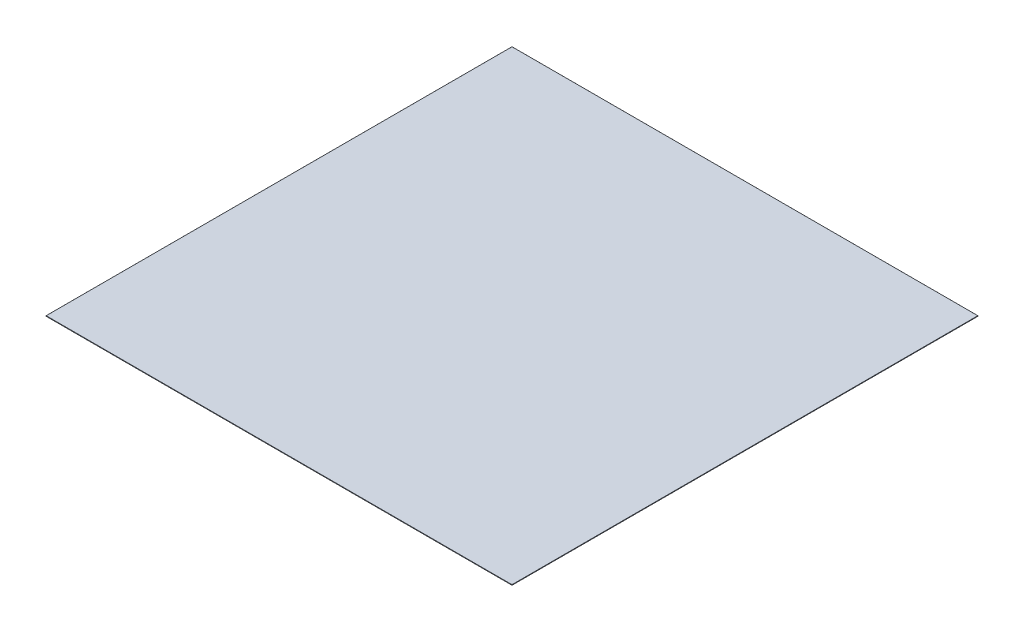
ISO-10303-21;
HEADER;
FILE_DESCRIPTION(('STEP AP214'),'2;1');
FILE_NAME('part.step','',(''),(''),'','','');
FILE_SCHEMA(('AUTOMOTIVE_DESIGN { 1 0 10303 214 1 1 1 1 }'));
ENDSEC;
DATA;
#1=APPLICATION_CONTEXT('core data for automotive mechanical design processes');
#2=APPLICATION_PROTOCOL_DEFINITION('international standard','automotive_design',2000,#1);
#3=PRODUCT_CONTEXT('',#1,'mechanical');
#4=PRODUCT('Part','Part','',(#3));
#5=PRODUCT_RELATED_PRODUCT_CATEGORY('part','',(#4));
#6=PRODUCT_DEFINITION_FORMATION('','',#4);
#7=PRODUCT_DEFINITION_CONTEXT('part definition',#1,'design');
#8=PRODUCT_DEFINITION('design','',#6,#7);
#9=PRODUCT_DEFINITION_SHAPE('','',#8);
#10=(LENGTH_UNIT() NAMED_UNIT(*) SI_UNIT(.MILLI.,.METRE.));
#11=(NAMED_UNIT(*) PLANE_ANGLE_UNIT() SI_UNIT($,.RADIAN.));
#12=(NAMED_UNIT(*) SI_UNIT($,.STERADIAN.) SOLID_ANGLE_UNIT());
#13=UNCERTAINTY_MEASURE_WITH_UNIT(LENGTH_MEASURE(1.E-05),#10,'distance_accuracy_value','');
#14=(GEOMETRIC_REPRESENTATION_CONTEXT(3) GLOBAL_UNCERTAINTY_ASSIGNED_CONTEXT((#13)) GLOBAL_UNIT_ASSIGNED_CONTEXT((#10,
#11,#12)) REPRESENTATION_CONTEXT('',''));
#15=CARTESIAN_POINT('',(0.,0.,0.));
#16=DIRECTION('',(0.,0.,1.));
#17=DIRECTION('',(1.,0.,0.));
#18=AXIS2_PLACEMENT_3D('',#15,#16,#17);
#19=CARTESIAN_POINT('',(-45.,0.05,45.));
#20=DIRECTION('',(1.,0.,0.));
#21=DIRECTION('',(0.,0.,-1.));
#22=AXIS2_PLACEMENT_3D('',#19,#20,#21);
#23=PLANE('',#22);
#24=DIRECTION('',(0.,-1.,0.));
#25=VECTOR('',#24,1.);
#26=CARTESIAN_POINT('',(-45.,0.05,-45.));
#27=LINE('',#26,#25);
#28=CARTESIAN_POINT('',(-45.,0.03,-45.));
#29=VERTEX_POINT('',#28);
#30=CARTESIAN_POINT('',(-45.,-0.03,-45.));
#31=VERTEX_POINT('',#30);
#32=EDGE_CURVE('E142',#29,#31,#27,.T.);
#33=ORIENTED_EDGE('',*,*,#32,.T.);
#34=DIRECTION('',(0.,0.,1.));
#35=VECTOR('',#34,1.);
#36=CARTESIAN_POINT('',(-45.,-0.03,45.));
#37=LINE('',#36,#35);
#38=CARTESIAN_POINT('',(-45.,-0.03,45.));
#39=VERTEX_POINT('',#38);
#40=EDGE_CURVE('E151',#31,#39,#37,.T.);
#41=ORIENTED_EDGE('',*,*,#40,.T.);
#42=DIRECTION('',(0.,-1.,0.));
#43=VECTOR('',#42,1.);
#44=CARTESIAN_POINT('',(-45.,0.05,45.));
#45=LINE('',#44,#43);
#46=CARTESIAN_POINT('',(-45.,0.03,45.));
#47=VERTEX_POINT('',#46);
#48=EDGE_CURVE('E120',#47,#39,#45,.T.);
#49=ORIENTED_EDGE('',*,*,#48,.F.);
#50=DIRECTION('',(0.,0.,1.));
#51=VECTOR('',#50,1.);
#52=CARTESIAN_POINT('',(-45.,0.03,45.));
#53=LINE('',#52,#51);
#54=EDGE_CURVE('E153',#47,#29,#53,.F.);
#55=ORIENTED_EDGE('',*,*,#54,.T.);
#56=EDGE_LOOP('',(#33,#41,#49,#55));
#57=FACE_BOUND('',#56,.T.);
#58=ADVANCED_FACE('F33',(#57),#23,.F.);
#59=CARTESIAN_POINT('',(-45.,0.05,45.));
#60=DIRECTION('',(0.,0.,-1.));
#61=DIRECTION('',(-1.,0.,0.));
#62=AXIS2_PLACEMENT_3D('',#59,#60,#61);
#63=PLANE('',#62);
#64=ORIENTED_EDGE('',*,*,#48,.T.);
#65=DIRECTION('',(1.,0.,0.));
#66=VECTOR('',#65,1.);
#67=CARTESIAN_POINT('',(45.,-0.03,45.));
#68=LINE('',#67,#66);
#69=CARTESIAN_POINT('',(45.,-0.03,45.));
#70=VERTEX_POINT('',#69);
#71=EDGE_CURVE('E119',#39,#70,#68,.T.);
#72=ORIENTED_EDGE('',*,*,#71,.T.);
#73=DIRECTION('',(0.,-1.,0.));
#74=VECTOR('',#73,1.);
#75=CARTESIAN_POINT('',(45.,0.05,45.));
#76=LINE('',#75,#74);
#77=CARTESIAN_POINT('',(45.,0.03,45.));
#78=VERTEX_POINT('',#77);
#79=EDGE_CURVE('E102',#78,#70,#76,.T.);
#80=ORIENTED_EDGE('',*,*,#79,.F.);
#81=DIRECTION('',(1.,0.,0.));
#82=VECTOR('',#81,1.);
#83=CARTESIAN_POINT('',(-45.,0.03,45.));
#84=LINE('',#83,#82);
#85=EDGE_CURVE('E116',#78,#47,#84,.F.);
#86=ORIENTED_EDGE('',*,*,#85,.T.);
#87=EDGE_LOOP('',(#64,#72,#80,#86));
#88=FACE_BOUND('',#87,.T.);
#89=ADVANCED_FACE('F115',(#88),#63,.F.);
#90=CARTESIAN_POINT('',(45.,0.05,45.));
#91=DIRECTION('',(-1.,0.,0.));
#92=DIRECTION('',(0.,0.,1.));
#93=AXIS2_PLACEMENT_3D('',#90,#91,#92);
#94=PLANE('',#93);
#95=ORIENTED_EDGE('',*,*,#79,.T.);
#96=DIRECTION('',(0.,0.,-1.));
#97=VECTOR('',#96,1.);
#98=CARTESIAN_POINT('',(45.,-0.03,-45.));
#99=LINE('',#98,#97);
#100=CARTESIAN_POINT('',(45.,-0.03,-45.));
#101=VERTEX_POINT('',#100);
#102=EDGE_CURVE('E108',#70,#101,#99,.T.);
#103=ORIENTED_EDGE('',*,*,#102,.T.);
#104=DIRECTION('',(0.,-1.,0.));
#105=VECTOR('',#104,1.);
#106=CARTESIAN_POINT('',(45.,0.05,-45.));
#107=LINE('',#106,#105);
#108=CARTESIAN_POINT('',(45.,0.03,-45.));
#109=VERTEX_POINT('',#108);
#110=EDGE_CURVE('E104',#109,#101,#107,.T.);
#111=ORIENTED_EDGE('',*,*,#110,.F.);
#112=DIRECTION('',(0.,0.,-1.));
#113=VECTOR('',#112,1.);
#114=CARTESIAN_POINT('',(45.,0.03,45.));
#115=LINE('',#114,#113);
#116=EDGE_CURVE('E99',#109,#78,#115,.F.);
#117=ORIENTED_EDGE('',*,*,#116,.T.);
#118=EDGE_LOOP('',(#95,#103,#111,#117));
#119=FACE_BOUND('',#118,.T.);
#120=ADVANCED_FACE('F101',(#119),#94,.F.);
#121=CARTESIAN_POINT('',(-45.,0.05,-45.));
#122=DIRECTION('',(0.,0.,1.));
#123=DIRECTION('',(1.,0.,0.));
#124=AXIS2_PLACEMENT_3D('',#121,#122,#123);
#125=PLANE('',#124);
#126=ORIENTED_EDGE('',*,*,#110,.T.);
#127=DIRECTION('',(-1.,0.,0.));
#128=VECTOR('',#127,1.);
#129=CARTESIAN_POINT('',(-45.,-0.03,-45.));
#130=LINE('',#129,#128);
#131=EDGE_CURVE('E155',#101,#31,#130,.T.);
#132=ORIENTED_EDGE('',*,*,#131,.T.);
#133=ORIENTED_EDGE('',*,*,#32,.F.);
#134=DIRECTION('',(-1.,0.,0.));
#135=VECTOR('',#134,1.);
#136=CARTESIAN_POINT('',(-45.,0.03,-45.));
#137=LINE('',#136,#135);
#138=EDGE_CURVE('E157',#29,#109,#137,.F.);
#139=ORIENTED_EDGE('',*,*,#138,.T.);
#140=EDGE_LOOP('',(#126,#132,#133,#139));
#141=FACE_BOUND('',#140,.T.);
#142=ADVANCED_FACE('F195',(#141),#125,.F.);
#143=CARTESIAN_POINT('',(-45.,0.05,-45.));
#144=DIRECTION('',(0.,-1.,0.));
#145=DIRECTION('',(0.,0.,-1.));
#146=AXIS2_PLACEMENT_3D('',#143,#144,#145);
#147=PLANE('',#146);
#148=DIRECTION('',(0.,0.,-1.));
#149=VECTOR('',#148,1.);
#150=CARTESIAN_POINT('',(44.98,0.05,-45.));
#151=LINE('',#150,#149);
#152=CARTESIAN_POINT('',(44.98,0.05,44.98));
#153=VERTEX_POINT('',#152);
#154=CARTESIAN_POINT('',(44.98,0.05,-44.98));
#155=VERTEX_POINT('',#154);
#156=EDGE_CURVE('E42',#153,#155,#151,.T.);
#157=ORIENTED_EDGE('',*,*,#156,.T.);
#158=DIRECTION('',(-1.,0.,0.));
#159=VECTOR('',#158,1.);
#160=CARTESIAN_POINT('',(-45.,0.05,-44.98));
#161=LINE('',#160,#159);
#162=CARTESIAN_POINT('',(-44.98,0.05,-44.98));
#163=VERTEX_POINT('',#162);
#164=EDGE_CURVE('E11',#155,#163,#161,.T.);
#165=ORIENTED_EDGE('',*,*,#164,.T.);
#166=DIRECTION('',(0.,0.,1.));
#167=VECTOR('',#166,1.);
#168=CARTESIAN_POINT('',(-44.98,0.05,-45.));
#169=LINE('',#168,#167);
#170=CARTESIAN_POINT('',(-44.98,0.05,44.98));
#171=VERTEX_POINT('',#170);
#172=EDGE_CURVE('E149',#163,#171,#169,.T.);
#173=ORIENTED_EDGE('',*,*,#172,.T.);
#174=DIRECTION('',(1.,0.,0.));
#175=VECTOR('',#174,1.);
#176=CARTESIAN_POINT('',(-45.,0.05,44.98));
#177=LINE('',#176,#175);
#178=EDGE_CURVE('E53',#171,#153,#177,.T.);
#179=ORIENTED_EDGE('',*,*,#178,.T.);
#180=EDGE_LOOP('',(#157,#165,#173,#179));
#181=FACE_BOUND('',#180,.T.);
#182=ADVANCED_FACE('F201',(#181),#147,.F.);
#183=CARTESIAN_POINT('',(-45.,-0.05,-45.));
#184=DIRECTION('',(0.,-1.,0.));
#185=DIRECTION('',(0.,0.,-1.));
#186=AXIS2_PLACEMENT_3D('',#183,#184,#185);
#187=PLANE('',#186);
#188=DIRECTION('',(0.,0.,-1.));
#189=VECTOR('',#188,1.);
#190=CARTESIAN_POINT('',(44.98,-0.05,45.));
#191=LINE('',#190,#189);
#192=CARTESIAN_POINT('',(44.98,-0.05,-44.98));
#193=VERTEX_POINT('',#192);
#194=CARTESIAN_POINT('',(44.98,-0.05,44.98));
#195=VERTEX_POINT('',#194);
#196=EDGE_CURVE('E162',#193,#195,#191,.F.);
#197=ORIENTED_EDGE('',*,*,#196,.T.);
#198=DIRECTION('',(1.,0.,0.));
#199=VECTOR('',#198,1.);
#200=CARTESIAN_POINT('',(-45.,-0.05,44.98));
#201=LINE('',#200,#199);
#202=CARTESIAN_POINT('',(-44.98,-0.05,44.98));
#203=VERTEX_POINT('',#202);
#204=EDGE_CURVE('E109',#195,#203,#201,.F.);
#205=ORIENTED_EDGE('',*,*,#204,.T.);
#206=DIRECTION('',(0.,0.,1.));
#207=VECTOR('',#206,1.);
#208=CARTESIAN_POINT('',(-44.98,-0.05,-45.));
#209=LINE('',#208,#207);
#210=CARTESIAN_POINT('',(-44.98,-0.05,-44.98));
#211=VERTEX_POINT('',#210);
#212=EDGE_CURVE('E166',#203,#211,#209,.F.);
#213=ORIENTED_EDGE('',*,*,#212,.T.);
#214=DIRECTION('',(-1.,0.,0.));
#215=VECTOR('',#214,1.);
#216=CARTESIAN_POINT('',(45.,-0.05,-44.98));
#217=LINE('',#216,#215);
#218=EDGE_CURVE('E164',#211,#193,#217,.F.);
#219=ORIENTED_EDGE('',*,*,#218,.T.);
#220=EDGE_LOOP('',(#197,#205,#213,#219));
#221=FACE_BOUND('',#220,.T.);
#222=ADVANCED_FACE('F203',(#221),#187,.T.);
#223=CARTESIAN_POINT('',(-45.,-0.03,-44.98));
#224=DIRECTION('',(1.,0.,0.));
#225=DIRECTION('',(0.,0.,-1.));
#226=AXIS2_PLACEMENT_3D('',#223,#224,#225);
#227=CYLINDRICAL_SURFACE('',#226,0.02);
#228=CARTESIAN_POINT('',(44.98,-0.03,-44.98));
#229=DIRECTION('',(0.707106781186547,0.,0.707106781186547));
#230=DIRECTION('',(0.707106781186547,0.,-0.707106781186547));
#231=AXIS2_PLACEMENT_3D('',#228,#229,#230);
#232=ELLIPSE('',#231,0.0282842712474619,0.02);
#233=EDGE_CURVE('E143',#193,#101,#232,.T.);
#234=ORIENTED_EDGE('',*,*,#233,.F.);
#235=ORIENTED_EDGE('',*,*,#218,.F.);
#236=CARTESIAN_POINT('',(-44.98,-0.03,-44.98));
#237=DIRECTION('',(0.707106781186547,0.,-0.707106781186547));
#238=DIRECTION('',(-0.707106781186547,0.,-0.707106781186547));
#239=AXIS2_PLACEMENT_3D('',#236,#237,#238);
#240=ELLIPSE('',#239,0.0282842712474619,0.02);
#241=EDGE_CURVE('E139',#31,#211,#240,.F.);
#242=ORIENTED_EDGE('',*,*,#241,.F.);
#243=ORIENTED_EDGE('',*,*,#131,.F.);
#244=EDGE_LOOP('',(#234,#235,#242,#243));
#245=FACE_BOUND('',#244,.T.);
#246=ADVANCED_FACE('F182',(#245),#227,.T.);
#247=CARTESIAN_POINT('',(-44.98,-0.03,45.));
#248=DIRECTION('',(0.,0.,-1.));
#249=DIRECTION('',(-1.,0.,0.));
#250=AXIS2_PLACEMENT_3D('',#247,#248,#249);
#251=CYLINDRICAL_SURFACE('',#250,0.02);
#252=ORIENTED_EDGE('',*,*,#241,.T.);
#253=ORIENTED_EDGE('',*,*,#212,.F.);
#254=CARTESIAN_POINT('',(-44.98,-0.03,44.98));
#255=DIRECTION('',(-0.707106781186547,0.,-0.707106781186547));
#256=DIRECTION('',(0.707106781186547,0.,-0.707106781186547));
#257=AXIS2_PLACEMENT_3D('',#254,#255,#256);
#258=ELLIPSE('',#257,0.0282842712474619,0.02);
#259=EDGE_CURVE('E130',#39,#203,#258,.F.);
#260=ORIENTED_EDGE('',*,*,#259,.F.);
#261=ORIENTED_EDGE('',*,*,#40,.F.);
#262=EDGE_LOOP('',(#252,#253,#260,#261));
#263=FACE_BOUND('',#262,.T.);
#264=ADVANCED_FACE('F186',(#263),#251,.T.);
#265=CARTESIAN_POINT('',(44.98,-0.03,45.));
#266=DIRECTION('',(0.,0.,1.));
#267=DIRECTION('',(1.,0.,0.));
#268=AXIS2_PLACEMENT_3D('',#265,#266,#267);
#269=CYLINDRICAL_SURFACE('',#268,0.02);
#270=ORIENTED_EDGE('',*,*,#233,.T.);
#271=ORIENTED_EDGE('',*,*,#102,.F.);
#272=CARTESIAN_POINT('',(44.98,-0.03,44.98));
#273=DIRECTION('',(-0.707106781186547,0.,0.707106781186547));
#274=DIRECTION('',(0.707106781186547,0.,0.707106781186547));
#275=AXIS2_PLACEMENT_3D('',#272,#273,#274);
#276=ELLIPSE('',#275,0.0282842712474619,0.02);
#277=EDGE_CURVE('E129',#195,#70,#276,.T.);
#278=ORIENTED_EDGE('',*,*,#277,.F.);
#279=ORIENTED_EDGE('',*,*,#196,.F.);
#280=EDGE_LOOP('',(#270,#271,#278,#279));
#281=FACE_BOUND('',#280,.T.);
#282=ADVANCED_FACE('F194',(#281),#269,.T.);
#283=CARTESIAN_POINT('',(-45.,-0.03,44.98));
#284=DIRECTION('',(-1.,0.,0.));
#285=DIRECTION('',(0.,0.,1.));
#286=AXIS2_PLACEMENT_3D('',#283,#284,#285);
#287=CYLINDRICAL_SURFACE('',#286,0.02);
#288=ORIENTED_EDGE('',*,*,#259,.T.);
#289=ORIENTED_EDGE('',*,*,#204,.F.);
#290=ORIENTED_EDGE('',*,*,#277,.T.);
#291=ORIENTED_EDGE('',*,*,#71,.F.);
#292=EDGE_LOOP('',(#288,#289,#290,#291));
#293=FACE_BOUND('',#292,.T.);
#294=ADVANCED_FACE('F189',(#293),#287,.T.);
#295=CARTESIAN_POINT('',(-45.,0.03,44.98));
#296=DIRECTION('',(1.,0.,0.));
#297=DIRECTION('',(0.,0.,-1.));
#298=AXIS2_PLACEMENT_3D('',#295,#296,#297);
#299=CYLINDRICAL_SURFACE('',#298,0.02);
#300=CARTESIAN_POINT('',(-44.98,0.03,44.98));
#301=DIRECTION('',(0.707106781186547,0.,0.707106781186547));
#302=DIRECTION('',(-0.707106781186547,0.,0.707106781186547));
#303=AXIS2_PLACEMENT_3D('',#300,#301,#302);
#304=ELLIPSE('',#303,0.0282842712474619,0.02);
#305=EDGE_CURVE('E125',#47,#171,#304,.F.);
#306=ORIENTED_EDGE('',*,*,#305,.F.);
#307=ORIENTED_EDGE('',*,*,#85,.F.);
#308=CARTESIAN_POINT('',(44.98,0.03,44.98));
#309=DIRECTION('',(0.707106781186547,0.,-0.707106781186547));
#310=DIRECTION('',(0.707106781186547,0.,0.707106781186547));
#311=AXIS2_PLACEMENT_3D('',#308,#309,#310);
#312=ELLIPSE('',#311,0.0282842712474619,0.02);
#313=EDGE_CURVE('E37',#153,#78,#312,.T.);
#314=ORIENTED_EDGE('',*,*,#313,.F.);
#315=ORIENTED_EDGE('',*,*,#178,.F.);
#316=EDGE_LOOP('',(#306,#307,#314,#315));
#317=FACE_BOUND('',#316,.T.);
#318=ADVANCED_FACE('F35',(#317),#299,.T.);
#319=CARTESIAN_POINT('',(44.98,0.03,-45.));
#320=DIRECTION('',(0.,0.,-1.));
#321=DIRECTION('',(-1.,0.,0.));
#322=AXIS2_PLACEMENT_3D('',#319,#320,#321);
#323=CYLINDRICAL_SURFACE('',#322,0.02);
#324=ORIENTED_EDGE('',*,*,#313,.T.);
#325=ORIENTED_EDGE('',*,*,#116,.F.);
#326=CARTESIAN_POINT('',(44.98,0.03,-44.98));
#327=DIRECTION('',(-0.707106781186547,0.,-0.707106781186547));
#328=DIRECTION('',(0.707106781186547,0.,-0.707106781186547));
#329=AXIS2_PLACEMENT_3D('',#326,#327,#328);
#330=ELLIPSE('',#329,0.0282842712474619,0.02);
#331=EDGE_CURVE('E132',#155,#109,#330,.T.);
#332=ORIENTED_EDGE('',*,*,#331,.F.);
#333=ORIENTED_EDGE('',*,*,#156,.F.);
#334=EDGE_LOOP('',(#324,#325,#332,#333));
#335=FACE_BOUND('',#334,.T.);
#336=ADVANCED_FACE('F128',(#335),#323,.T.);
#337=CARTESIAN_POINT('',(-44.98,0.03,-45.));
#338=DIRECTION('',(0.,0.,1.));
#339=DIRECTION('',(1.,0.,0.));
#340=AXIS2_PLACEMENT_3D('',#337,#338,#339);
#341=CYLINDRICAL_SURFACE('',#340,0.02);
#342=ORIENTED_EDGE('',*,*,#305,.T.);
#343=ORIENTED_EDGE('',*,*,#172,.F.);
#344=CARTESIAN_POINT('',(-44.98,0.03,-44.98));
#345=DIRECTION('',(-0.707106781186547,0.,0.707106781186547));
#346=DIRECTION('',(0.707106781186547,0.,0.707106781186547));
#347=AXIS2_PLACEMENT_3D('',#344,#345,#346);
#348=ELLIPSE('',#347,0.0282842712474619,0.02);
#349=EDGE_CURVE('E135',#29,#163,#348,.F.);
#350=ORIENTED_EDGE('',*,*,#349,.F.);
#351=ORIENTED_EDGE('',*,*,#54,.F.);
#352=EDGE_LOOP('',(#342,#343,#350,#351));
#353=FACE_BOUND('',#352,.T.);
#354=ADVANCED_FACE('F200',(#353),#341,.T.);
#355=CARTESIAN_POINT('',(-45.,0.03,-44.98));
#356=DIRECTION('',(-1.,0.,0.));
#357=DIRECTION('',(0.,0.,1.));
#358=AXIS2_PLACEMENT_3D('',#355,#356,#357);
#359=CYLINDRICAL_SURFACE('',#358,0.02);
#360=ORIENTED_EDGE('',*,*,#331,.T.);
#361=ORIENTED_EDGE('',*,*,#138,.F.);
#362=ORIENTED_EDGE('',*,*,#349,.T.);
#363=ORIENTED_EDGE('',*,*,#164,.F.);
#364=EDGE_LOOP('',(#360,#361,#362,#363));
#365=FACE_BOUND('',#364,.T.);
#366=ADVANCED_FACE('F198',(#365),#359,.T.);
#367=CLOSED_SHELL('',(#58,#89,#120,#142,#182,#222,#246,#264,#282,#294,#318,#336,#354,#366));
#368=MANIFOLD_SOLID_BREP('B2',#367);
#369=ADVANCED_BREP_SHAPE_REPRESENTATION('',(#18,#368),#14);
#370=SHAPE_DEFINITION_REPRESENTATION(#9,#369);
ENDSEC;
END-ISO-10303-21;
